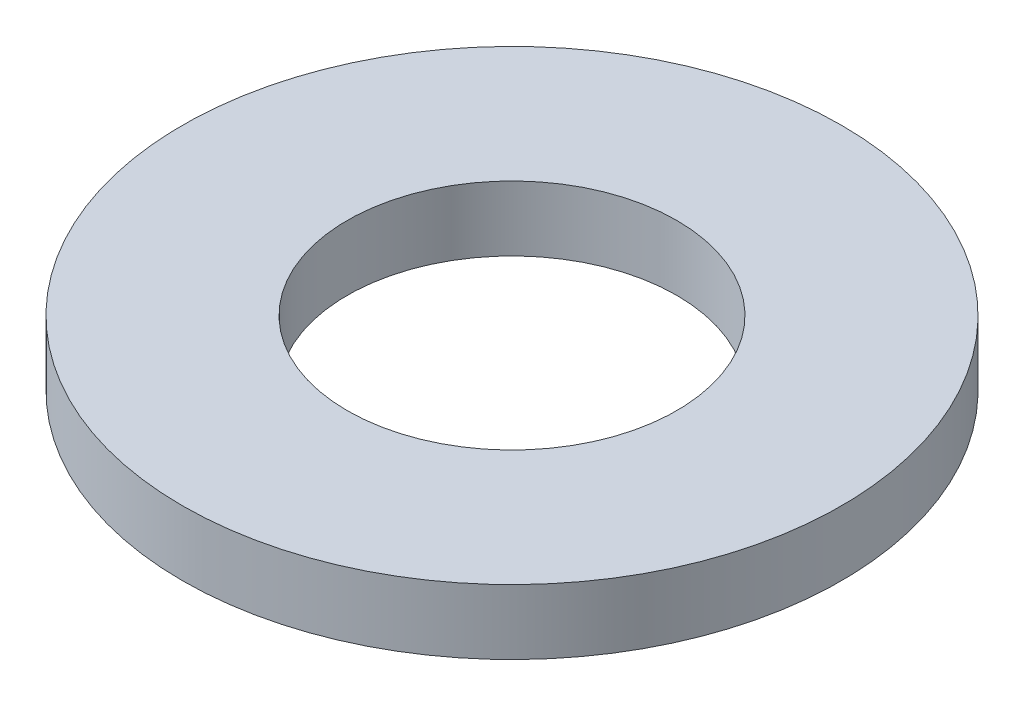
ISO-10303-21;
HEADER;
FILE_DESCRIPTION(('STEP AP214'),'2;1');
FILE_NAME('part.step','',(''),(''),'','','');
FILE_SCHEMA(('AUTOMOTIVE_DESIGN { 1 0 10303 214 1 1 1 1 }'));
ENDSEC;
DATA;
#1=APPLICATION_CONTEXT('core data for automotive mechanical design processes');
#2=APPLICATION_PROTOCOL_DEFINITION('international standard','automotive_design',2000,#1);
#3=PRODUCT_CONTEXT('',#1,'mechanical');
#4=PRODUCT('Part','Part','',(#3));
#5=PRODUCT_RELATED_PRODUCT_CATEGORY('part','',(#4));
#6=PRODUCT_DEFINITION_FORMATION('','',#4);
#7=PRODUCT_DEFINITION_CONTEXT('part definition',#1,'design');
#8=PRODUCT_DEFINITION('design','',#6,#7);
#9=PRODUCT_DEFINITION_SHAPE('','',#8);
#10=(LENGTH_UNIT() NAMED_UNIT(*) SI_UNIT(.MILLI.,.METRE.));
#11=(NAMED_UNIT(*) PLANE_ANGLE_UNIT() SI_UNIT($,.RADIAN.));
#12=(NAMED_UNIT(*) SI_UNIT($,.STERADIAN.) SOLID_ANGLE_UNIT());
#13=UNCERTAINTY_MEASURE_WITH_UNIT(LENGTH_MEASURE(1.E-05),#10,'distance_accuracy_value','');
#14=(GEOMETRIC_REPRESENTATION_CONTEXT(3) GLOBAL_UNCERTAINTY_ASSIGNED_CONTEXT((#13)) GLOBAL_UNIT_ASSIGNED_CONTEXT((#10,
#11,#12)) REPRESENTATION_CONTEXT('',''));
#15=CARTESIAN_POINT('',(0.,0.,0.));
#16=DIRECTION('',(0.,0.,1.));
#17=DIRECTION('',(1.,0.,0.));
#18=AXIS2_PLACEMENT_3D('',#15,#16,#17);
#19=CARTESIAN_POINT('',(0.,2.032,0.));
#20=DIRECTION('',(0.,-1.,0.));
#21=DIRECTION('',(0.,0.,-1.));
#22=AXIS2_PLACEMENT_3D('',#19,#20,#21);
#23=CYLINDRICAL_SURFACE('',#22,10.3124);
#24=CARTESIAN_POINT('',(0.,2.032,0.));
#25=DIRECTION('',(0.,1.,0.));
#26=DIRECTION('',(0.,0.,1.));
#27=AXIS2_PLACEMENT_3D('',#24,#25,#26);
#28=CIRCLE('',#27,10.3124);
#29=CARTESIAN_POINT('',(0.,2.032,10.3124));
#30=VERTEX_POINT('',#29);
#31=EDGE_CURVE('E10',#30,#30,#28,.T.);
#32=ORIENTED_EDGE('',*,*,#31,.F.);
#33=EDGE_LOOP('',(#32));
#34=FACE_BOUND('',#33,.T.);
#35=CARTESIAN_POINT('',(0.,0.,0.));
#36=DIRECTION('',(0.,1.,0.));
#37=DIRECTION('',(0.,0.,1.));
#38=AXIS2_PLACEMENT_3D('',#35,#36,#37);
#39=CIRCLE('',#38,10.3124);
#40=CARTESIAN_POINT('',(0.,0.,10.3124));
#41=VERTEX_POINT('',#40);
#42=EDGE_CURVE('E33',#41,#41,#39,.T.);
#43=ORIENTED_EDGE('',*,*,#42,.T.);
#44=EDGE_LOOP('',(#43));
#45=FACE_BOUND('',#44,.T.);
#46=ADVANCED_FACE('F30',(#34,#45),#23,.T.);
#47=CARTESIAN_POINT('',(0.,2.032,0.));
#48=DIRECTION('',(0.,1.,0.));
#49=DIRECTION('',(0.,0.,1.));
#50=AXIS2_PLACEMENT_3D('',#47,#48,#49);
#51=PLANE('',#50);
#52=CARTESIAN_POINT('',(0.,2.032,0.));
#53=DIRECTION('',(0.,1.,0.));
#54=DIRECTION('',(0.,0.,1.));
#55=AXIS2_PLACEMENT_3D('',#52,#53,#54);
#56=CIRCLE('',#55,5.1562);
#57=CARTESIAN_POINT('',(0.,2.032,5.1562));
#58=VERTEX_POINT('',#57);
#59=EDGE_CURVE('E42',#58,#58,#56,.T.);
#60=ORIENTED_EDGE('',*,*,#59,.F.);
#61=EDGE_LOOP('',(#60));
#62=FACE_BOUND('',#61,.T.);
#63=ORIENTED_EDGE('',*,*,#31,.T.);
#64=EDGE_LOOP('',(#63));
#65=FACE_BOUND('',#64,.T.);
#66=ADVANCED_FACE('F57',(#62,#65),#51,.T.);
#67=CARTESIAN_POINT('',(0.,0.,0.));
#68=DIRECTION('',(0.,1.,0.));
#69=DIRECTION('',(0.,0.,1.));
#70=AXIS2_PLACEMENT_3D('',#67,#68,#69);
#71=PLANE('',#70);
#72=CARTESIAN_POINT('',(0.,0.,0.));
#73=DIRECTION('',(0.,1.,0.));
#74=DIRECTION('',(0.,0.,1.));
#75=AXIS2_PLACEMENT_3D('',#72,#73,#74);
#76=CIRCLE('',#75,5.1562);
#77=CARTESIAN_POINT('',(0.,0.,5.1562));
#78=VERTEX_POINT('',#77);
#79=EDGE_CURVE('E40',#78,#78,#76,.T.);
#80=ORIENTED_EDGE('',*,*,#79,.T.);
#81=EDGE_LOOP('',(#80));
#82=FACE_BOUND('',#81,.T.);
#83=ORIENTED_EDGE('',*,*,#42,.F.);
#84=EDGE_LOOP('',(#83));
#85=FACE_BOUND('',#84,.T.);
#86=ADVANCED_FACE('F48',(#82,#85),#71,.F.);
#87=CARTESIAN_POINT('',(0.,0.,0.));
#88=DIRECTION('',(0.,1.,0.));
#89=DIRECTION('',(0.,0.,1.));
#90=AXIS2_PLACEMENT_3D('',#87,#88,#89);
#91=CYLINDRICAL_SURFACE('',#90,5.1562);
#92=ORIENTED_EDGE('',*,*,#79,.F.);
#93=EDGE_LOOP('',(#92));
#94=FACE_BOUND('',#93,.T.);
#95=ORIENTED_EDGE('',*,*,#59,.T.);
#96=EDGE_LOOP('',(#95));
#97=FACE_BOUND('',#96,.T.);
#98=ADVANCED_FACE('F51',(#94,#97),#91,.F.);
#99=CLOSED_SHELL('',(#46,#66,#86,#98));
#100=MANIFOLD_SOLID_BREP('B2',#99);
#101=ADVANCED_BREP_SHAPE_REPRESENTATION('',(#18,#100),#14);
#102=SHAPE_DEFINITION_REPRESENTATION(#9,#101);
ENDSEC;
END-ISO-10303-21;
